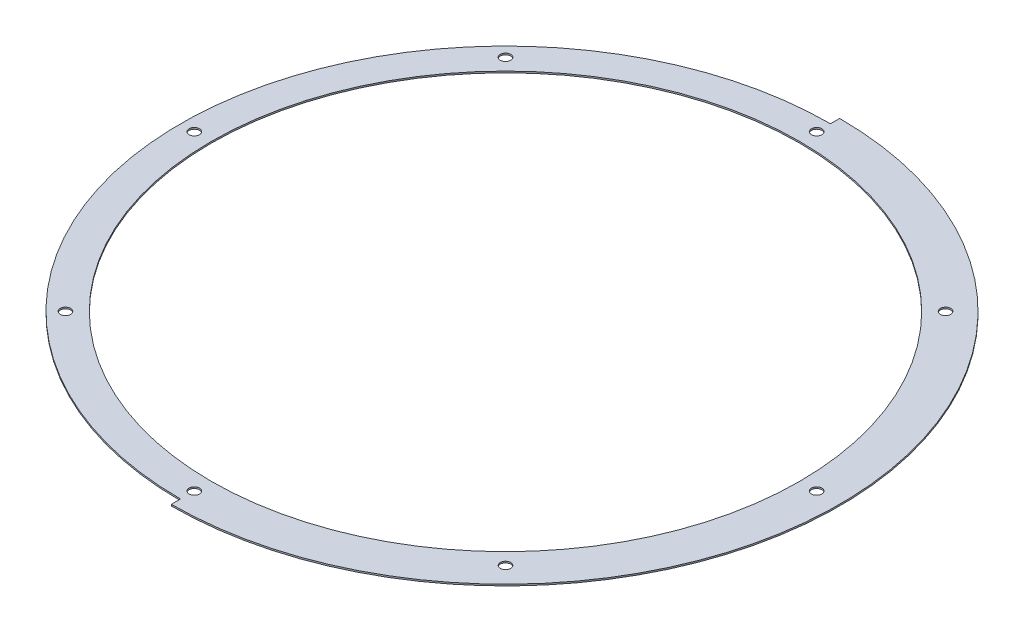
ISO-10303-21;
HEADER;
FILE_DESCRIPTION(('STEP AP214'),'2;1');
FILE_NAME('part.step','',(''),(''),'','','');
FILE_SCHEMA(('AUTOMOTIVE_DESIGN { 1 0 10303 214 1 1 1 1 }'));
ENDSEC;
DATA;
#1=APPLICATION_CONTEXT('core data for automotive mechanical design processes');
#2=APPLICATION_PROTOCOL_DEFINITION('international standard','automotive_design',2000,#1);
#3=PRODUCT_CONTEXT('',#1,'mechanical');
#4=PRODUCT('Part','Part','',(#3));
#5=PRODUCT_RELATED_PRODUCT_CATEGORY('part','',(#4));
#6=PRODUCT_DEFINITION_FORMATION('','',#4);
#7=PRODUCT_DEFINITION_CONTEXT('part definition',#1,'design');
#8=PRODUCT_DEFINITION('design','',#6,#7);
#9=PRODUCT_DEFINITION_SHAPE('','',#8);
#10=(LENGTH_UNIT() NAMED_UNIT(*) SI_UNIT(.MILLI.,.METRE.));
#11=(NAMED_UNIT(*) PLANE_ANGLE_UNIT() SI_UNIT($,.RADIAN.));
#12=(NAMED_UNIT(*) SI_UNIT($,.STERADIAN.) SOLID_ANGLE_UNIT());
#13=UNCERTAINTY_MEASURE_WITH_UNIT(LENGTH_MEASURE(1.E-05),#10,'distance_accuracy_value','');
#14=(GEOMETRIC_REPRESENTATION_CONTEXT(3) GLOBAL_UNCERTAINTY_ASSIGNED_CONTEXT((#13)) GLOBAL_UNIT_ASSIGNED_CONTEXT((#10,
#11,#12)) REPRESENTATION_CONTEXT('',''));
#15=CARTESIAN_POINT('',(0.,0.,0.));
#16=DIRECTION('',(0.,0.,1.));
#17=DIRECTION('',(1.,0.,0.));
#18=AXIS2_PLACEMENT_3D('',#15,#16,#17);
#19=CARTESIAN_POINT('',(0.,0.635,0.));
#20=DIRECTION('',(0.,1.,0.));
#21=DIRECTION('',(0.,0.,1.));
#22=AXIS2_PLACEMENT_3D('',#19,#20,#21);
#23=PLANE('',#22);
#24=CARTESIAN_POINT('',(-91.1495996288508,0.635,91.149599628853));
#25=DIRECTION('',(0.,1.,0.));
#26=DIRECTION('',(0.,0.,1.));
#27=AXIS2_PLACEMENT_3D('',#24,#25,#26);
#28=CIRCLE('',#27,2.15);
#29=CARTESIAN_POINT('',(-91.1495996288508,0.635,93.299599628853));
#30=VERTEX_POINT('',#29);
#31=EDGE_CURVE('E411',#30,#30,#28,.T.);
#32=ORIENTED_EDGE('',*,*,#31,.F.);
#33=EDGE_LOOP('',(#32));
#34=FACE_BOUND('',#33,.T.);
#35=CARTESIAN_POINT('',(-128.905,0.635,1.35020820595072E-12));
#36=DIRECTION('',(0.,1.,0.));
#37=DIRECTION('',(0.,0.,1.));
#38=AXIS2_PLACEMENT_3D('',#35,#36,#37);
#39=CIRCLE('',#38,2.15000000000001);
#40=CARTESIAN_POINT('',(-128.905,0.635,2.15000000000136));
#41=VERTEX_POINT('',#40);
#42=EDGE_CURVE('E413',#41,#41,#39,.T.);
#43=ORIENTED_EDGE('',*,*,#42,.F.);
#44=EDGE_LOOP('',(#43));
#45=FACE_BOUND('',#44,.T.);
#46=CARTESIAN_POINT('',(-91.1495996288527,0.635,-91.1495996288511));
#47=DIRECTION('',(0.,1.,0.));
#48=DIRECTION('',(0.,0.,1.));
#49=AXIS2_PLACEMENT_3D('',#46,#47,#48);
#50=CIRCLE('',#49,2.15);
#51=CARTESIAN_POINT('',(-91.1495996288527,0.635,-88.9995996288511));
#52=VERTEX_POINT('',#51);
#53=EDGE_CURVE('E421',#52,#52,#50,.T.);
#54=ORIENTED_EDGE('',*,*,#53,.F.);
#55=EDGE_LOOP('',(#54));
#56=FACE_BOUND('',#55,.T.);
#57=CARTESIAN_POINT('',(0.,0.635,-128.905));
#58=DIRECTION('',(0.,1.,0.));
#59=DIRECTION('',(0.,0.,1.));
#60=AXIS2_PLACEMENT_3D('',#57,#58,#59);
#61=CIRCLE('',#60,2.15);
#62=CARTESIAN_POINT('',(0.,0.635,-126.755));
#63=VERTEX_POINT('',#62);
#64=EDGE_CURVE('E427',#63,#63,#61,.T.);
#65=ORIENTED_EDGE('',*,*,#64,.F.);
#66=EDGE_LOOP('',(#65));
#67=FACE_BOUND('',#66,.T.);
#68=CARTESIAN_POINT('',(91.1495996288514,0.635,-91.1495996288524));
#69=DIRECTION('',(0.,1.,0.));
#70=DIRECTION('',(0.,0.,1.));
#71=AXIS2_PLACEMENT_3D('',#68,#69,#70);
#72=CIRCLE('',#71,2.15);
#73=CARTESIAN_POINT('',(91.1495996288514,0.635,-88.9995996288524));
#74=VERTEX_POINT('',#73);
#75=EDGE_CURVE('E433',#74,#74,#72,.T.);
#76=ORIENTED_EDGE('',*,*,#75,.F.);
#77=EDGE_LOOP('',(#76));
#78=FACE_BOUND('',#77,.T.);
#79=CARTESIAN_POINT('',(128.905,0.635,-4.50069401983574E-13));
#80=DIRECTION('',(0.,1.,0.));
#81=DIRECTION('',(0.,0.,1.));
#82=AXIS2_PLACEMENT_3D('',#79,#80,#81);
#83=CIRCLE('',#82,2.15000000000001);
#84=CARTESIAN_POINT('',(128.905,0.635,2.14999999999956));
#85=VERTEX_POINT('',#84);
#86=EDGE_CURVE('E439',#85,#85,#83,.T.);
#87=ORIENTED_EDGE('',*,*,#86,.F.);
#88=EDGE_LOOP('',(#87));
#89=FACE_BOUND('',#88,.T.);
#90=CARTESIAN_POINT('',(91.1495996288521,0.635,91.1495996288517));
#91=DIRECTION('',(0.,1.,0.));
#92=DIRECTION('',(0.,0.,1.));
#93=AXIS2_PLACEMENT_3D('',#90,#91,#92);
#94=CIRCLE('',#93,2.15);
#95=CARTESIAN_POINT('',(91.1495996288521,0.635,93.2995996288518));
#96=VERTEX_POINT('',#95);
#97=EDGE_CURVE('E445',#96,#96,#94,.T.);
#98=ORIENTED_EDGE('',*,*,#97,.F.);
#99=EDGE_LOOP('',(#98));
#100=FACE_BOUND('',#99,.T.);
#101=CARTESIAN_POINT('',(0.,0.635,128.905));
#102=DIRECTION('',(0.,1.,0.));
#103=DIRECTION('',(0.,0.,1.));
#104=AXIS2_PLACEMENT_3D('',#101,#102,#103);
#105=CIRCLE('',#104,2.15);
#106=CARTESIAN_POINT('',(0.,0.635,131.055));
#107=VERTEX_POINT('',#106);
#108=EDGE_CURVE('E451',#107,#107,#105,.T.);
#109=ORIENTED_EDGE('',*,*,#108,.F.);
#110=EDGE_LOOP('',(#109));
#111=FACE_BOUND('',#110,.T.);
#112=CARTESIAN_POINT('',(0.,0.635,0.));
#113=DIRECTION('',(0.,1.,0.));
#114=DIRECTION('',(0.,0.,1.));
#115=AXIS2_PLACEMENT_3D('',#112,#113,#114);
#116=CIRCLE('',#115,138.43);
#117=CARTESIAN_POINT('',(0.127116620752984,0.635,138.429941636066));
#118=VERTEX_POINT('',#117);
#119=CARTESIAN_POINT('',(0.127116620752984,0.635,-138.429941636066));
#120=VERTEX_POINT('',#119);
#121=EDGE_CURVE('E182',#118,#120,#116,.T.);
#122=ORIENTED_EDGE('',*,*,#121,.T.);
#123=CARTESIAN_POINT('',(0.127,0.635,-138.302941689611));
#124=DIRECTION('',(0.,1.,0.));
#125=DIRECTION('',(0.,0.,1.));
#126=AXIS2_PLACEMENT_3D('',#123,#124,#125);
#127=CIRCLE('',#126,0.127);
#128=CARTESIAN_POINT('',(0.,0.635,-138.302941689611));
#129=VERTEX_POINT('',#128);
#130=EDGE_CURVE('E155',#120,#129,#127,.T.);
#131=ORIENTED_EDGE('',*,*,#130,.T.);
#132=DIRECTION('',(0.,0.,1.));
#133=VECTOR('',#132,1.);
#134=CARTESIAN_POINT('',(0.,0.635,-134.62));
#135=LINE('',#134,#133);
#136=CARTESIAN_POINT('',(0.,0.635,-134.746940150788));
#137=VERTEX_POINT('',#136);
#138=EDGE_CURVE('E132',#129,#137,#135,.T.);
#139=ORIENTED_EDGE('',*,*,#138,.T.);
#140=CARTESIAN_POINT('',(-0.127,0.635,-134.746940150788));
#141=DIRECTION('',(0.,1.,0.));
#142=DIRECTION('',(0.,0.,1.));
#143=AXIS2_PLACEMENT_3D('',#140,#141,#142);
#144=CIRCLE('',#143,0.127);
#145=CARTESIAN_POINT('',(-0.126880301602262,0.635,-134.619940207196));
#146=VERTEX_POINT('',#145);
#147=EDGE_CURVE('E167',#137,#146,#144,.F.);
#148=ORIENTED_EDGE('',*,*,#147,.T.);
#149=CARTESIAN_POINT('',(0.,0.635,0.));
#150=DIRECTION('',(0.,1.,0.));
#151=DIRECTION('',(0.,0.,1.));
#152=AXIS2_PLACEMENT_3D('',#149,#150,#151);
#153=CIRCLE('',#152,134.62);
#154=CARTESIAN_POINT('',(-0.126880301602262,0.635,134.619940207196));
#155=VERTEX_POINT('',#154);
#156=EDGE_CURVE('E139',#146,#155,#153,.T.);
#157=ORIENTED_EDGE('',*,*,#156,.T.);
#158=CARTESIAN_POINT('',(-0.127,0.635,134.746940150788));
#159=DIRECTION('',(0.,1.,0.));
#160=DIRECTION('',(0.,0.,1.));
#161=AXIS2_PLACEMENT_3D('',#158,#159,#160);
#162=CIRCLE('',#161,0.127);
#163=CARTESIAN_POINT('',(0.,0.635,134.746940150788));
#164=VERTEX_POINT('',#163);
#165=EDGE_CURVE('E11',#155,#164,#162,.F.);
#166=ORIENTED_EDGE('',*,*,#165,.T.);
#167=DIRECTION('',(0.,0.,1.));
#168=VECTOR('',#167,1.);
#169=CARTESIAN_POINT('',(0.,0.635,134.62));
#170=LINE('',#169,#168);
#171=CARTESIAN_POINT('',(0.,0.635,138.302941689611));
#172=VERTEX_POINT('',#171);
#173=EDGE_CURVE('E142',#164,#172,#170,.T.);
#174=ORIENTED_EDGE('',*,*,#173,.T.);
#175=CARTESIAN_POINT('',(0.127,0.635,138.302941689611));
#176=DIRECTION('',(0.,1.,0.));
#177=DIRECTION('',(0.,0.,1.));
#178=AXIS2_PLACEMENT_3D('',#175,#176,#177);
#179=CIRCLE('',#178,0.127);
#180=EDGE_CURVE('E153',#172,#118,#179,.T.);
#181=ORIENTED_EDGE('',*,*,#180,.T.);
#182=EDGE_LOOP('',(#122,#131,#139,#148,#157,#166,#174,#181));
#183=FACE_BOUND('',#182,.T.);
#184=CARTESIAN_POINT('',(0.,0.635,0.));
#185=DIRECTION('',(0.,1.,0.));
#186=DIRECTION('',(0.,0.,1.));
#187=AXIS2_PLACEMENT_3D('',#184,#185,#186);
#188=CIRCLE('',#187,121.92);
#189=CARTESIAN_POINT('',(0.,0.635,121.92));
#190=VERTEX_POINT('',#189);
#191=EDGE_CURVE('E178',#190,#190,#188,.T.);
#192=ORIENTED_EDGE('',*,*,#191,.F.);
#193=EDGE_LOOP('',(#192));
#194=FACE_BOUND('',#193,.T.);
#195=ADVANCED_FACE('F47',(#34,#45,#56,#67,#78,#89,#100,#111,#183,#194),#23,.T.);
#196=CARTESIAN_POINT('',(0.,0.,0.));
#197=DIRECTION('',(0.,1.,0.));
#198=DIRECTION('',(0.,0.,1.));
#199=AXIS2_PLACEMENT_3D('',#196,#197,#198);
#200=PLANE('',#199);
#201=CARTESIAN_POINT('',(-91.1495996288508,0.,91.149599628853));
#202=DIRECTION('',(0.,1.,0.));
#203=DIRECTION('',(0.,0.,1.));
#204=AXIS2_PLACEMENT_3D('',#201,#202,#203);
#205=CIRCLE('',#204,2.15);
#206=CARTESIAN_POINT('',(-91.1495996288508,0.,93.299599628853));
#207=VERTEX_POINT('',#206);
#208=EDGE_CURVE('E409',#207,#207,#205,.T.);
#209=ORIENTED_EDGE('',*,*,#208,.T.);
#210=EDGE_LOOP('',(#209));
#211=FACE_BOUND('',#210,.T.);
#212=CARTESIAN_POINT('',(-128.905,0.,1.35020820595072E-12));
#213=DIRECTION('',(0.,1.,0.));
#214=DIRECTION('',(0.,0.,1.));
#215=AXIS2_PLACEMENT_3D('',#212,#213,#214);
#216=CIRCLE('',#215,2.15000000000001);
#217=CARTESIAN_POINT('',(-128.905,0.,2.15000000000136));
#218=VERTEX_POINT('',#217);
#219=EDGE_CURVE('E418',#218,#218,#216,.T.);
#220=ORIENTED_EDGE('',*,*,#219,.T.);
#221=EDGE_LOOP('',(#220));
#222=FACE_BOUND('',#221,.T.);
#223=CARTESIAN_POINT('',(-91.1495996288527,0.,-91.1495996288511));
#224=DIRECTION('',(0.,1.,0.));
#225=DIRECTION('',(0.,0.,1.));
#226=AXIS2_PLACEMENT_3D('',#223,#224,#225);
#227=CIRCLE('',#226,2.15);
#228=CARTESIAN_POINT('',(-91.1495996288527,0.,-88.9995996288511));
#229=VERTEX_POINT('',#228);
#230=EDGE_CURVE('E424',#229,#229,#227,.T.);
#231=ORIENTED_EDGE('',*,*,#230,.T.);
#232=EDGE_LOOP('',(#231));
#233=FACE_BOUND('',#232,.T.);
#234=CARTESIAN_POINT('',(0.,0.,-128.905));
#235=DIRECTION('',(0.,1.,0.));
#236=DIRECTION('',(0.,0.,1.));
#237=AXIS2_PLACEMENT_3D('',#234,#235,#236);
#238=CIRCLE('',#237,2.15);
#239=CARTESIAN_POINT('',(0.,0.,-126.755));
#240=VERTEX_POINT('',#239);
#241=EDGE_CURVE('E430',#240,#240,#238,.T.);
#242=ORIENTED_EDGE('',*,*,#241,.T.);
#243=EDGE_LOOP('',(#242));
#244=FACE_BOUND('',#243,.T.);
#245=CARTESIAN_POINT('',(91.1495996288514,0.,-91.1495996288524));
#246=DIRECTION('',(0.,1.,0.));
#247=DIRECTION('',(0.,0.,1.));
#248=AXIS2_PLACEMENT_3D('',#245,#246,#247);
#249=CIRCLE('',#248,2.15);
#250=CARTESIAN_POINT('',(91.1495996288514,0.,-88.9995996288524));
#251=VERTEX_POINT('',#250);
#252=EDGE_CURVE('E436',#251,#251,#249,.T.);
#253=ORIENTED_EDGE('',*,*,#252,.T.);
#254=EDGE_LOOP('',(#253));
#255=FACE_BOUND('',#254,.T.);
#256=CARTESIAN_POINT('',(128.905,0.,-4.50069401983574E-13));
#257=DIRECTION('',(0.,1.,0.));
#258=DIRECTION('',(0.,0.,1.));
#259=AXIS2_PLACEMENT_3D('',#256,#257,#258);
#260=CIRCLE('',#259,2.15000000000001);
#261=CARTESIAN_POINT('',(128.905,0.,2.14999999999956));
#262=VERTEX_POINT('',#261);
#263=EDGE_CURVE('E442',#262,#262,#260,.T.);
#264=ORIENTED_EDGE('',*,*,#263,.T.);
#265=EDGE_LOOP('',(#264));
#266=FACE_BOUND('',#265,.T.);
#267=CARTESIAN_POINT('',(91.1495996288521,0.,91.1495996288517));
#268=DIRECTION('',(0.,1.,0.));
#269=DIRECTION('',(0.,0.,1.));
#270=AXIS2_PLACEMENT_3D('',#267,#268,#269);
#271=CIRCLE('',#270,2.15);
#272=CARTESIAN_POINT('',(91.1495996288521,0.,93.2995996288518));
#273=VERTEX_POINT('',#272);
#274=EDGE_CURVE('E448',#273,#273,#271,.T.);
#275=ORIENTED_EDGE('',*,*,#274,.T.);
#276=EDGE_LOOP('',(#275));
#277=FACE_BOUND('',#276,.T.);
#278=CARTESIAN_POINT('',(0.,0.,128.905));
#279=DIRECTION('',(0.,1.,0.));
#280=DIRECTION('',(0.,0.,1.));
#281=AXIS2_PLACEMENT_3D('',#278,#279,#280);
#282=CIRCLE('',#281,2.15);
#283=CARTESIAN_POINT('',(0.,0.,131.055));
#284=VERTEX_POINT('',#283);
#285=EDGE_CURVE('E454',#284,#284,#282,.T.);
#286=ORIENTED_EDGE('',*,*,#285,.T.);
#287=EDGE_LOOP('',(#286));
#288=FACE_BOUND('',#287,.T.);
#289=DIRECTION('',(0.,0.,1.));
#290=VECTOR('',#289,1.);
#291=CARTESIAN_POINT('',(0.,0.,-134.62));
#292=LINE('',#291,#290);
#293=CARTESIAN_POINT('',(0.,0.,-138.302941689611));
#294=VERTEX_POINT('',#293);
#295=CARTESIAN_POINT('',(0.,0.,-134.746940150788));
#296=VERTEX_POINT('',#295);
#297=EDGE_CURVE('E129',#294,#296,#292,.T.);
#298=ORIENTED_EDGE('',*,*,#297,.F.);
#299=CARTESIAN_POINT('',(0.127,0.,-138.302941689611));
#300=DIRECTION('',(0.,1.,0.));
#301=DIRECTION('',(0.,0.,1.));
#302=AXIS2_PLACEMENT_3D('',#299,#300,#301);
#303=CIRCLE('',#302,0.127);
#304=CARTESIAN_POINT('',(0.127116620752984,0.,-138.429941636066));
#305=VERTEX_POINT('',#304);
#306=EDGE_CURVE('E112',#294,#305,#303,.F.);
#307=ORIENTED_EDGE('',*,*,#306,.T.);
#308=CARTESIAN_POINT('',(0.,0.,0.));
#309=DIRECTION('',(0.,1.,0.));
#310=DIRECTION('',(0.,0.,1.));
#311=AXIS2_PLACEMENT_3D('',#308,#309,#310);
#312=CIRCLE('',#311,138.43);
#313=CARTESIAN_POINT('',(0.127116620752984,0.,138.429941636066));
#314=VERTEX_POINT('',#313);
#315=EDGE_CURVE('E140',#314,#305,#312,.T.);
#316=ORIENTED_EDGE('',*,*,#315,.F.);
#317=CARTESIAN_POINT('',(0.127,0.,138.302941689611));
#318=DIRECTION('',(0.,1.,0.));
#319=DIRECTION('',(0.,0.,1.));
#320=AXIS2_PLACEMENT_3D('',#317,#318,#319);
#321=CIRCLE('',#320,0.127);
#322=CARTESIAN_POINT('',(0.,0.,138.302941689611));
#323=VERTEX_POINT('',#322);
#324=EDGE_CURVE('E123',#314,#323,#321,.F.);
#325=ORIENTED_EDGE('',*,*,#324,.T.);
#326=DIRECTION('',(0.,0.,1.));
#327=VECTOR('',#326,1.);
#328=CARTESIAN_POINT('',(0.,0.,134.62));
#329=LINE('',#328,#327);
#330=CARTESIAN_POINT('',(0.,0.,134.746940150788));
#331=VERTEX_POINT('',#330);
#332=EDGE_CURVE('E144',#331,#323,#329,.T.);
#333=ORIENTED_EDGE('',*,*,#332,.F.);
#334=CARTESIAN_POINT('',(-0.127,0.,134.746940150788));
#335=DIRECTION('',(0.,1.,0.));
#336=DIRECTION('',(0.,0.,1.));
#337=AXIS2_PLACEMENT_3D('',#334,#335,#336);
#338=CIRCLE('',#337,0.127);
#339=CARTESIAN_POINT('',(-0.126880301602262,0.,134.619940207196));
#340=VERTEX_POINT('',#339);
#341=EDGE_CURVE('E55',#331,#340,#338,.T.);
#342=ORIENTED_EDGE('',*,*,#341,.T.);
#343=CARTESIAN_POINT('',(0.,0.,0.));
#344=DIRECTION('',(0.,1.,0.));
#345=DIRECTION('',(0.,0.,1.));
#346=AXIS2_PLACEMENT_3D('',#343,#344,#345);
#347=CIRCLE('',#346,134.62);
#348=CARTESIAN_POINT('',(-0.126880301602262,0.,-134.619940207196));
#349=VERTEX_POINT('',#348);
#350=EDGE_CURVE('E170',#349,#340,#347,.T.);
#351=ORIENTED_EDGE('',*,*,#350,.F.);
#352=CARTESIAN_POINT('',(-0.127,0.,-134.746940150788));
#353=DIRECTION('',(0.,1.,0.));
#354=DIRECTION('',(0.,0.,1.));
#355=AXIS2_PLACEMENT_3D('',#352,#353,#354);
#356=CIRCLE('',#355,0.127);
#357=EDGE_CURVE('E138',#349,#296,#356,.T.);
#358=ORIENTED_EDGE('',*,*,#357,.T.);
#359=EDGE_LOOP('',(#298,#307,#316,#325,#333,#342,#351,#358));
#360=FACE_BOUND('',#359,.T.);
#361=CARTESIAN_POINT('',(0.,0.,0.));
#362=DIRECTION('',(0.,1.,0.));
#363=DIRECTION('',(0.,0.,1.));
#364=AXIS2_PLACEMENT_3D('',#361,#362,#363);
#365=CIRCLE('',#364,121.92);
#366=CARTESIAN_POINT('',(0.,0.,121.92));
#367=VERTEX_POINT('',#366);
#368=EDGE_CURVE('E457',#367,#367,#365,.T.);
#369=ORIENTED_EDGE('',*,*,#368,.T.);
#370=EDGE_LOOP('',(#369));
#371=FACE_BOUND('',#370,.T.);
#372=ADVANCED_FACE('F135',(#211,#222,#233,#244,#255,#266,#277,#288,#360,#371),#200,.F.);
#373=CARTESIAN_POINT('',(0.,0.635,0.));
#374=DIRECTION('',(0.,-1.,0.));
#375=DIRECTION('',(0.,0.,-1.));
#376=AXIS2_PLACEMENT_3D('',#373,#374,#375);
#377=CYLINDRICAL_SURFACE('',#376,134.62);
#378=ORIENTED_EDGE('',*,*,#156,.F.);
#379=DIRECTION('',(0.,-1.,0.));
#380=VECTOR('',#379,1.);
#381=CARTESIAN_POINT('',(-0.126880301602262,0.635,-134.619940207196));
#382=LINE('',#381,#380);
#383=EDGE_CURVE('E159',#146,#349,#382,.T.);
#384=ORIENTED_EDGE('',*,*,#383,.T.);
#385=ORIENTED_EDGE('',*,*,#350,.T.);
#386=DIRECTION('',(0.,-1.,0.));
#387=VECTOR('',#386,1.);
#388=CARTESIAN_POINT('',(-0.126880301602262,0.635,134.619940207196));
#389=LINE('',#388,#387);
#390=EDGE_CURVE('E157',#340,#155,#389,.F.);
#391=ORIENTED_EDGE('',*,*,#390,.T.);
#392=EDGE_LOOP('',(#378,#384,#385,#391));
#393=FACE_BOUND('',#392,.T.);
#394=ADVANCED_FACE('F176',(#393),#377,.T.);
#395=CARTESIAN_POINT('',(0.,0.635,134.62));
#396=DIRECTION('',(1.,0.,0.));
#397=DIRECTION('',(0.,0.,-1.));
#398=AXIS2_PLACEMENT_3D('',#395,#396,#397);
#399=PLANE('',#398);
#400=ORIENTED_EDGE('',*,*,#332,.T.);
#401=DIRECTION('',(0.,-1.,0.));
#402=VECTOR('',#401,1.);
#403=CARTESIAN_POINT('',(0.,0.635,138.302941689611));
#404=LINE('',#403,#402);
#405=EDGE_CURVE('E62',#323,#172,#404,.F.);
#406=ORIENTED_EDGE('',*,*,#405,.T.);
#407=ORIENTED_EDGE('',*,*,#173,.F.);
#408=DIRECTION('',(0.,1.,0.));
#409=VECTOR('',#408,1.);
#410=CARTESIAN_POINT('',(0.,0.,134.746940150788));
#411=LINE('',#410,#409);
#412=EDGE_CURVE('E162',#164,#331,#411,.F.);
#413=ORIENTED_EDGE('',*,*,#412,.T.);
#414=EDGE_LOOP('',(#400,#406,#407,#413));
#415=FACE_BOUND('',#414,.T.);
#416=ADVANCED_FACE('F180',(#415),#399,.F.);
#417=CARTESIAN_POINT('',(0.,0.635,0.));
#418=DIRECTION('',(0.,-1.,0.));
#419=DIRECTION('',(0.,0.,-1.));
#420=AXIS2_PLACEMENT_3D('',#417,#418,#419);
#421=CYLINDRICAL_SURFACE('',#420,138.43);
#422=ORIENTED_EDGE('',*,*,#315,.T.);
#423=DIRECTION('',(0.,-1.,0.));
#424=VECTOR('',#423,1.);
#425=CARTESIAN_POINT('',(0.127116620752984,0.635,-138.429941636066));
#426=LINE('',#425,#424);
#427=EDGE_CURVE('E117',#305,#120,#426,.F.);
#428=ORIENTED_EDGE('',*,*,#427,.T.);
#429=ORIENTED_EDGE('',*,*,#121,.F.);
#430=DIRECTION('',(0.,-1.,0.));
#431=VECTOR('',#430,1.);
#432=CARTESIAN_POINT('',(0.127116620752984,0.635,138.429941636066));
#433=LINE('',#432,#431);
#434=EDGE_CURVE('E122',#118,#314,#433,.T.);
#435=ORIENTED_EDGE('',*,*,#434,.T.);
#436=EDGE_LOOP('',(#422,#428,#429,#435));
#437=FACE_BOUND('',#436,.T.);
#438=ADVANCED_FACE('F218',(#437),#421,.T.);
#439=CARTESIAN_POINT('',(0.,0.635,-134.62));
#440=DIRECTION('',(1.,0.,0.));
#441=DIRECTION('',(0.,0.,-1.));
#442=AXIS2_PLACEMENT_3D('',#439,#440,#441);
#443=PLANE('',#442);
#444=ORIENTED_EDGE('',*,*,#138,.F.);
#445=DIRECTION('',(0.,-1.,0.));
#446=VECTOR('',#445,1.);
#447=CARTESIAN_POINT('',(0.,0.635,-138.302941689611));
#448=LINE('',#447,#446);
#449=EDGE_CURVE('E116',#129,#294,#448,.T.);
#450=ORIENTED_EDGE('',*,*,#449,.T.);
#451=ORIENTED_EDGE('',*,*,#297,.T.);
#452=DIRECTION('',(0.,1.,0.));
#453=VECTOR('',#452,1.);
#454=CARTESIAN_POINT('',(0.,0.635,-134.746940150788));
#455=LINE('',#454,#453);
#456=EDGE_CURVE('E133',#296,#137,#455,.T.);
#457=ORIENTED_EDGE('',*,*,#456,.T.);
#458=EDGE_LOOP('',(#444,#450,#451,#457));
#459=FACE_BOUND('',#458,.T.);
#460=ADVANCED_FACE('F128',(#459),#443,.F.);
#461=CARTESIAN_POINT('',(0.,0.635,0.));
#462=DIRECTION('',(0.,-1.,0.));
#463=DIRECTION('',(0.,0.,-1.));
#464=AXIS2_PLACEMENT_3D('',#461,#462,#463);
#465=CYLINDRICAL_SURFACE('',#464,121.92);
#466=ORIENTED_EDGE('',*,*,#191,.T.);
#467=EDGE_LOOP('',(#466));
#468=FACE_BOUND('',#467,.T.);
#469=ORIENTED_EDGE('',*,*,#368,.F.);
#470=EDGE_LOOP('',(#469));
#471=FACE_BOUND('',#470,.T.);
#472=ADVANCED_FACE('F213',(#468,#471),#465,.F.);
#473=CARTESIAN_POINT('',(0.,0.635,128.905));
#474=DIRECTION('',(0.,1.,0.));
#475=DIRECTION('',(0.,0.,1.));
#476=AXIS2_PLACEMENT_3D('',#473,#474,#475);
#477=CYLINDRICAL_SURFACE('',#476,2.15);
#478=ORIENTED_EDGE('',*,*,#285,.F.);
#479=EDGE_LOOP('',(#478));
#480=FACE_BOUND('',#479,.T.);
#481=ORIENTED_EDGE('',*,*,#108,.T.);
#482=EDGE_LOOP('',(#481));
#483=FACE_BOUND('',#482,.T.);
#484=ADVANCED_FACE('F248',(#480,#483),#477,.F.);
#485=CARTESIAN_POINT('',(91.1495996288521,0.635,91.1495996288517));
#486=DIRECTION('',(0.,1.,0.));
#487=DIRECTION('',(0.,0.,1.));
#488=AXIS2_PLACEMENT_3D('',#485,#486,#487);
#489=CYLINDRICAL_SURFACE('',#488,2.15);
#490=ORIENTED_EDGE('',*,*,#274,.F.);
#491=EDGE_LOOP('',(#490));
#492=FACE_BOUND('',#491,.T.);
#493=ORIENTED_EDGE('',*,*,#97,.T.);
#494=EDGE_LOOP('',(#493));
#495=FACE_BOUND('',#494,.T.);
#496=ADVANCED_FACE('F255',(#492,#495),#489,.F.);
#497=CARTESIAN_POINT('',(128.905,0.635,-4.50069401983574E-13));
#498=DIRECTION('',(0.,1.,0.));
#499=DIRECTION('',(0.,0.,1.));
#500=AXIS2_PLACEMENT_3D('',#497,#498,#499);
#501=CYLINDRICAL_SURFACE('',#500,2.15000000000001);
#502=ORIENTED_EDGE('',*,*,#263,.F.);
#503=EDGE_LOOP('',(#502));
#504=FACE_BOUND('',#503,.T.);
#505=ORIENTED_EDGE('',*,*,#86,.T.);
#506=EDGE_LOOP('',(#505));
#507=FACE_BOUND('',#506,.T.);
#508=ADVANCED_FACE('F262',(#504,#507),#501,.F.);
#509=CARTESIAN_POINT('',(91.1495996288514,0.635,-91.1495996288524));
#510=DIRECTION('',(0.,1.,0.));
#511=DIRECTION('',(0.,0.,1.));
#512=AXIS2_PLACEMENT_3D('',#509,#510,#511);
#513=CYLINDRICAL_SURFACE('',#512,2.15);
#514=ORIENTED_EDGE('',*,*,#252,.F.);
#515=EDGE_LOOP('',(#514));
#516=FACE_BOUND('',#515,.T.);
#517=ORIENTED_EDGE('',*,*,#75,.T.);
#518=EDGE_LOOP('',(#517));
#519=FACE_BOUND('',#518,.T.);
#520=ADVANCED_FACE('F270',(#516,#519),#513,.F.);
#521=CARTESIAN_POINT('',(0.,0.635,-128.905));
#522=DIRECTION('',(0.,1.,0.));
#523=DIRECTION('',(0.,0.,1.));
#524=AXIS2_PLACEMENT_3D('',#521,#522,#523);
#525=CYLINDRICAL_SURFACE('',#524,2.15);
#526=ORIENTED_EDGE('',*,*,#241,.F.);
#527=EDGE_LOOP('',(#526));
#528=FACE_BOUND('',#527,.T.);
#529=ORIENTED_EDGE('',*,*,#64,.T.);
#530=EDGE_LOOP('',(#529));
#531=FACE_BOUND('',#530,.T.);
#532=ADVANCED_FACE('F278',(#528,#531),#525,.F.);
#533=CARTESIAN_POINT('',(-91.1495996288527,0.635,-91.1495996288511));
#534=DIRECTION('',(0.,1.,0.));
#535=DIRECTION('',(0.,0.,1.));
#536=AXIS2_PLACEMENT_3D('',#533,#534,#535);
#537=CYLINDRICAL_SURFACE('',#536,2.15);
#538=ORIENTED_EDGE('',*,*,#230,.F.);
#539=EDGE_LOOP('',(#538));
#540=FACE_BOUND('',#539,.T.);
#541=ORIENTED_EDGE('',*,*,#53,.T.);
#542=EDGE_LOOP('',(#541));
#543=FACE_BOUND('',#542,.T.);
#544=ADVANCED_FACE('F286',(#540,#543),#537,.F.);
#545=CARTESIAN_POINT('',(-128.905,0.635,1.35020820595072E-12));
#546=DIRECTION('',(0.,1.,0.));
#547=DIRECTION('',(0.,0.,1.));
#548=AXIS2_PLACEMENT_3D('',#545,#546,#547);
#549=CYLINDRICAL_SURFACE('',#548,2.15000000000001);
#550=ORIENTED_EDGE('',*,*,#219,.F.);
#551=EDGE_LOOP('',(#550));
#552=FACE_BOUND('',#551,.T.);
#553=ORIENTED_EDGE('',*,*,#42,.T.);
#554=EDGE_LOOP('',(#553));
#555=FACE_BOUND('',#554,.T.);
#556=ADVANCED_FACE('F294',(#552,#555),#549,.F.);
#557=CARTESIAN_POINT('',(-91.1495996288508,0.635,91.149599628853));
#558=DIRECTION('',(0.,1.,0.));
#559=DIRECTION('',(0.,0.,1.));
#560=AXIS2_PLACEMENT_3D('',#557,#558,#559);
#561=CYLINDRICAL_SURFACE('',#560,2.15);
#562=ORIENTED_EDGE('',*,*,#208,.F.);
#563=EDGE_LOOP('',(#562));
#564=FACE_BOUND('',#563,.T.);
#565=ORIENTED_EDGE('',*,*,#31,.T.);
#566=EDGE_LOOP('',(#565));
#567=FACE_BOUND('',#566,.T.);
#568=ADVANCED_FACE('F200',(#564,#567),#561,.F.);
#569=CARTESIAN_POINT('',(0.127,0.635,-138.302941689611));
#570=DIRECTION('',(0.,-1.,0.));
#571=DIRECTION('',(0.,0.,-1.));
#572=AXIS2_PLACEMENT_3D('',#569,#570,#571);
#573=CYLINDRICAL_SURFACE('',#572,0.127);
#574=ORIENTED_EDGE('',*,*,#130,.F.);
#575=ORIENTED_EDGE('',*,*,#427,.F.);
#576=ORIENTED_EDGE('',*,*,#306,.F.);
#577=ORIENTED_EDGE('',*,*,#449,.F.);
#578=EDGE_LOOP('',(#574,#575,#576,#577));
#579=FACE_BOUND('',#578,.T.);
#580=ADVANCED_FACE('F115',(#579),#573,.T.);
#581=CARTESIAN_POINT('',(-0.127,0.635,-134.746940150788));
#582=DIRECTION('',(0.,-1.,0.));
#583=DIRECTION('',(0.,0.,-1.));
#584=AXIS2_PLACEMENT_3D('',#581,#582,#583);
#585=CYLINDRICAL_SURFACE('',#584,0.127);
#586=ORIENTED_EDGE('',*,*,#147,.F.);
#587=ORIENTED_EDGE('',*,*,#456,.F.);
#588=ORIENTED_EDGE('',*,*,#357,.F.);
#589=ORIENTED_EDGE('',*,*,#383,.F.);
#590=EDGE_LOOP('',(#586,#587,#588,#589));
#591=FACE_BOUND('',#590,.T.);
#592=ADVANCED_FACE('F191',(#591),#585,.F.);
#593=CARTESIAN_POINT('',(0.127,0.635,138.302941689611));
#594=DIRECTION('',(0.,-1.,0.));
#595=DIRECTION('',(0.,0.,-1.));
#596=AXIS2_PLACEMENT_3D('',#593,#594,#595);
#597=CYLINDRICAL_SURFACE('',#596,0.127);
#598=ORIENTED_EDGE('',*,*,#180,.F.);
#599=ORIENTED_EDGE('',*,*,#405,.F.);
#600=ORIENTED_EDGE('',*,*,#324,.F.);
#601=ORIENTED_EDGE('',*,*,#434,.F.);
#602=EDGE_LOOP('',(#598,#599,#600,#601));
#603=FACE_BOUND('',#602,.T.);
#604=ADVANCED_FACE('F193',(#603),#597,.T.);
#605=CARTESIAN_POINT('',(-0.127,0.635,134.746940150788));
#606=DIRECTION('',(0.,-1.,0.));
#607=DIRECTION('',(0.,0.,-1.));
#608=AXIS2_PLACEMENT_3D('',#605,#606,#607);
#609=CYLINDRICAL_SURFACE('',#608,0.127);
#610=ORIENTED_EDGE('',*,*,#165,.F.);
#611=ORIENTED_EDGE('',*,*,#390,.F.);
#612=ORIENTED_EDGE('',*,*,#341,.F.);
#613=ORIENTED_EDGE('',*,*,#412,.F.);
#614=EDGE_LOOP('',(#610,#611,#612,#613));
#615=FACE_BOUND('',#614,.T.);
#616=ADVANCED_FACE('F49',(#615),#609,.F.);
#617=CLOSED_SHELL('',(#195,#372,#394,#416,#438,#460,#472,#484,#496,#508,#520,#532,#544,#556,
#568,#580,#592,#604,#616));
#618=MANIFOLD_SOLID_BREP('B2',#617);
#619=ADVANCED_BREP_SHAPE_REPRESENTATION('',(#18,#618),#14);
#620=SHAPE_DEFINITION_REPRESENTATION(#9,#619);
ENDSEC;
END-ISO-10303-21;
